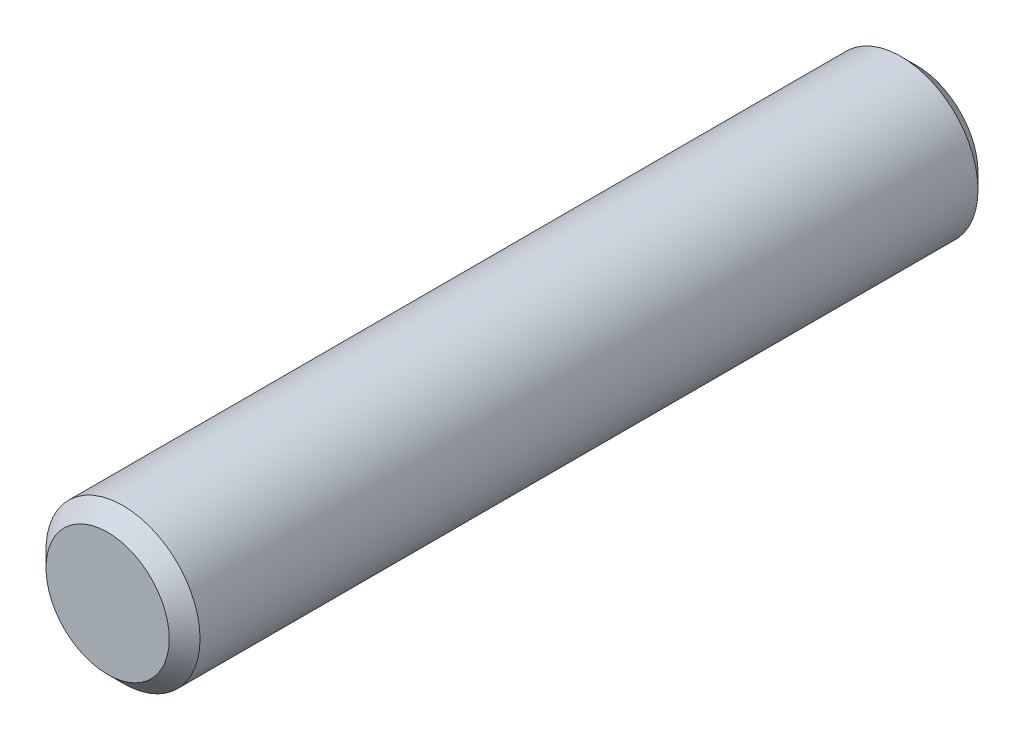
ISO-10303-21;
HEADER;
FILE_DESCRIPTION(('STEP AP214'),'2;1');
FILE_NAME('part.step','',(''),(''),'','','');
FILE_SCHEMA(('AUTOMOTIVE_DESIGN { 1 0 10303 214 1 1 1 1 }'));
ENDSEC;
DATA;
#1=APPLICATION_CONTEXT('core data for automotive mechanical design processes');
#2=APPLICATION_PROTOCOL_DEFINITION('international standard','automotive_design',2000,#1);
#3=PRODUCT_CONTEXT('',#1,'mechanical');
#4=PRODUCT('Part','Part','',(#3));
#5=PRODUCT_RELATED_PRODUCT_CATEGORY('part','',(#4));
#6=PRODUCT_DEFINITION_FORMATION('','',#4);
#7=PRODUCT_DEFINITION_CONTEXT('part definition',#1,'design');
#8=PRODUCT_DEFINITION('design','',#6,#7);
#9=PRODUCT_DEFINITION_SHAPE('','',#8);
#10=(LENGTH_UNIT() NAMED_UNIT(*) SI_UNIT(.MILLI.,.METRE.));
#11=(NAMED_UNIT(*) PLANE_ANGLE_UNIT() SI_UNIT($,.RADIAN.));
#12=(NAMED_UNIT(*) SI_UNIT($,.STERADIAN.) SOLID_ANGLE_UNIT());
#13=UNCERTAINTY_MEASURE_WITH_UNIT(LENGTH_MEASURE(1.E-05),#10,'distance_accuracy_value','');
#14=(GEOMETRIC_REPRESENTATION_CONTEXT(3) GLOBAL_UNCERTAINTY_ASSIGNED_CONTEXT((#13)) GLOBAL_UNIT_ASSIGNED_CONTEXT((#10,
#11,#12)) REPRESENTATION_CONTEXT('',''));
#15=CARTESIAN_POINT('',(0.,0.,0.));
#16=DIRECTION('',(0.,0.,1.));
#17=DIRECTION('',(1.,0.,0.));
#18=AXIS2_PLACEMENT_3D('',#15,#16,#17);
#19=CARTESIAN_POINT('',(0.,0.,105.));
#20=DIRECTION('',(0.,0.,-1.));
#21=DIRECTION('',(-1.,0.,0.));
#22=AXIS2_PLACEMENT_3D('',#19,#20,#21);
#23=CYLINDRICAL_SURFACE('',#22,10.);
#24=CARTESIAN_POINT('',(0.,0.,1.99999999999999));
#25=DIRECTION('',(0.,0.,1.));
#26=DIRECTION('',(1.,0.,0.));
#27=AXIS2_PLACEMENT_3D('',#24,#25,#26);
#28=CIRCLE('',#27,10.);
#29=CARTESIAN_POINT('',(10.,0.,1.99999999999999));
#30=VERTEX_POINT('',#29);
#31=EDGE_CURVE('E39',#30,#30,#28,.T.);
#32=ORIENTED_EDGE('',*,*,#31,.T.);
#33=EDGE_LOOP('',(#32));
#34=FACE_BOUND('',#33,.T.);
#35=CARTESIAN_POINT('',(0.,0.,103.));
#36=DIRECTION('',(0.,0.,1.));
#37=DIRECTION('',(1.,0.,0.));
#38=AXIS2_PLACEMENT_3D('',#35,#36,#37);
#39=CIRCLE('',#38,10.);
#40=CARTESIAN_POINT('',(10.,0.,103.));
#41=VERTEX_POINT('',#40);
#42=EDGE_CURVE('E43',#41,#41,#39,.F.);
#43=ORIENTED_EDGE('',*,*,#42,.T.);
#44=EDGE_LOOP('',(#43));
#45=FACE_BOUND('',#44,.T.);
#46=ADVANCED_FACE('F28',(#34,#45),#23,.T.);
#47=CARTESIAN_POINT('',(0.,0.,105.));
#48=DIRECTION('',(0.,0.,1.));
#49=DIRECTION('',(1.,0.,0.));
#50=AXIS2_PLACEMENT_3D('',#47,#48,#49);
#51=PLANE('',#50);
#52=CARTESIAN_POINT('',(0.,0.,105.));
#53=DIRECTION('',(0.,0.,1.));
#54=DIRECTION('',(1.,0.,0.));
#55=AXIS2_PLACEMENT_3D('',#52,#53,#54);
#56=CIRCLE('',#55,8.00000000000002);
#57=CARTESIAN_POINT('',(8.00000000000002,0.,105.));
#58=VERTEX_POINT('',#57);
#59=EDGE_CURVE('E10',#58,#58,#56,.T.);
#60=ORIENTED_EDGE('',*,*,#59,.T.);
#61=EDGE_LOOP('',(#60));
#62=FACE_BOUND('',#61,.T.);
#63=ADVANCED_FACE('F59',(#62),#51,.T.);
#64=CARTESIAN_POINT('',(0.,0.,0.));
#65=DIRECTION('',(0.,0.,1.));
#66=DIRECTION('',(1.,0.,0.));
#67=AXIS2_PLACEMENT_3D('',#64,#65,#66);
#68=PLANE('',#67);
#69=CARTESIAN_POINT('',(0.,0.,0.));
#70=DIRECTION('',(0.,0.,1.));
#71=DIRECTION('',(1.,0.,0.));
#72=AXIS2_PLACEMENT_3D('',#69,#70,#71);
#73=CIRCLE('',#72,7.99999999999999);
#74=CARTESIAN_POINT('',(7.99999999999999,0.,0.));
#75=VERTEX_POINT('',#74);
#76=EDGE_CURVE('E35',#75,#75,#73,.F.);
#77=ORIENTED_EDGE('',*,*,#76,.T.);
#78=EDGE_LOOP('',(#77));
#79=FACE_BOUND('',#78,.T.);
#80=ADVANCED_FACE('F56',(#79),#68,.F.);
#81=CARTESIAN_POINT('',(0.,0.,1.99999999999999));
#82=DIRECTION('',(0.,0.,1.));
#83=DIRECTION('',(1.,0.,0.));
#84=AXIS2_PLACEMENT_3D('',#81,#82,#83);
#85=CONICAL_SURFACE('',#84,10.,0.785398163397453);
#86=ORIENTED_EDGE('',*,*,#76,.F.);
#87=EDGE_LOOP('',(#86));
#88=FACE_BOUND('',#87,.T.);
#89=ORIENTED_EDGE('',*,*,#31,.F.);
#90=EDGE_LOOP('',(#89));
#91=FACE_BOUND('',#90,.T.);
#92=ADVANCED_FACE('F52',(#88,#91),#85,.T.);
#93=CARTESIAN_POINT('',(0.,0.,105.));
#94=DIRECTION('',(0.,0.,-1.));
#95=DIRECTION('',(-1.,0.,0.));
#96=AXIS2_PLACEMENT_3D('',#93,#94,#95);
#97=CONICAL_SURFACE('',#96,8.00000000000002,0.785398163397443);
#98=ORIENTED_EDGE('',*,*,#42,.F.);
#99=EDGE_LOOP('',(#98));
#100=FACE_BOUND('',#99,.T.);
#101=ORIENTED_EDGE('',*,*,#59,.F.);
#102=EDGE_LOOP('',(#101));
#103=FACE_BOUND('',#102,.T.);
#104=ADVANCED_FACE('F30',(#100,#103),#97,.T.);
#105=CLOSED_SHELL('',(#46,#63,#80,#92,#104));
#106=MANIFOLD_SOLID_BREP('B2',#105);
#107=ADVANCED_BREP_SHAPE_REPRESENTATION('',(#18,#106),#14);
#108=SHAPE_DEFINITION_REPRESENTATION(#9,#107);
ENDSEC;
END-ISO-10303-21;
